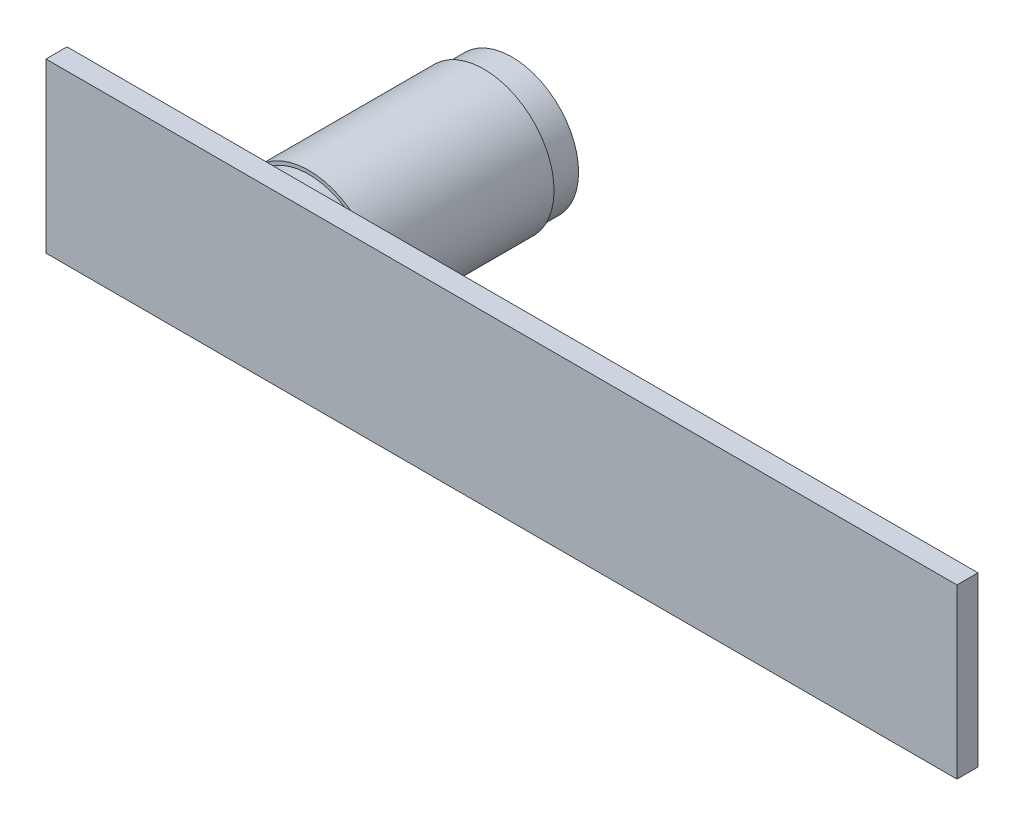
from build123d import *

# Parameters (mm, degrees)
SKETCH2_W           = 130
SKETCH2_H           = 24
BOSS_EXTRUDE1_DEPTH = 3
SKETCH3_R           = 5
BOSS_EXTRUDE2_DEPTH = 3
CUT_EXTRUDE1_DEPTH  = 1


with BuildPart() as part:
    # Sketch1 → Revolve1 (revolve)
    with BuildSketch(Plane(origin=(0, 0, 0), x_dir=(0, 0, -1), z_dir=(1, 0, 0)), mode=Mode.PRIVATE) as revolve1_sk:
        Polygon((-33.623416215, -8.782506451), (-0.623416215, -8.782506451), (-0.623416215, 0.717493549), (-4.623416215, 0.717493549), (-4.623416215, 1.217493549), (-29.623416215, 1.217493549), (-29.623416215, 0.717493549), (-33.623416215, 0.717493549), align=None)
    revolve(revolve1_sk.sketch.rotate(Axis((0, -8.782506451, 33.623416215), (0, 0, -1)), 90), axis=Axis((0, -8.782506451, 33.623416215), (0, 0, -1)))

    # Sketch2 → Boss-Extrude1 (add)
    with BuildSketch(Plane.XY.offset(33.623416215)):
        with Locations((34.5, -8.782506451)):
            Rectangle(SKETCH2_W, SKETCH2_H)
    extrude(amount=BOSS_EXTRUDE1_DEPTH)

    # Sketch3 → Boss-Extrude2 (add)
    with BuildSketch(Plane(origin=(0, 0, 33.623416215), x_dir=(-1, 0, 0), z_dir=(0, 0, -1))):
        with Locations((19.5, -8.782506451)):
            Circle(SKETCH3_R)
    boss_extrude2 = extrude(amount=BOSS_EXTRUDE2_DEPTH)

    # Sketch4 → Cut-Extrude1 (cut, symmetric)
    with BuildSketch(Plane(origin=(0, -8.782506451, 0), x_dir=(1, 0, 0), z_dir=(0, 1, 0))):
        with BuildLine():
            Line((-23.5, -30.623416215), (-23.5, -29.03648764))
            Line((-23.5, -29.03648764), (-15.5, -29.03648764))
            Line((-15.5, -29.03648764), (-15.5, -30.623416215))
            ThreePointArc((-15.5, -30.623416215), (-19.5, -32.280270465), (-23.5, -30.623416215))
        make_face()
    cut_extrude1 = extrude(amount=CUT_EXTRUDE1_DEPTH, both=True, mode=Mode.SUBTRACT)

    # Mirror1: Boss-Extrude2, Cut-Extrude1 across plane
    add(boss_extrude2.mirror(Plane.ZY.offset(-34.5)))
    add(cut_extrude1.mirror(Plane.ZY.offset(-34.5)), mode=Mode.SUBTRACT)


solid = part.part
